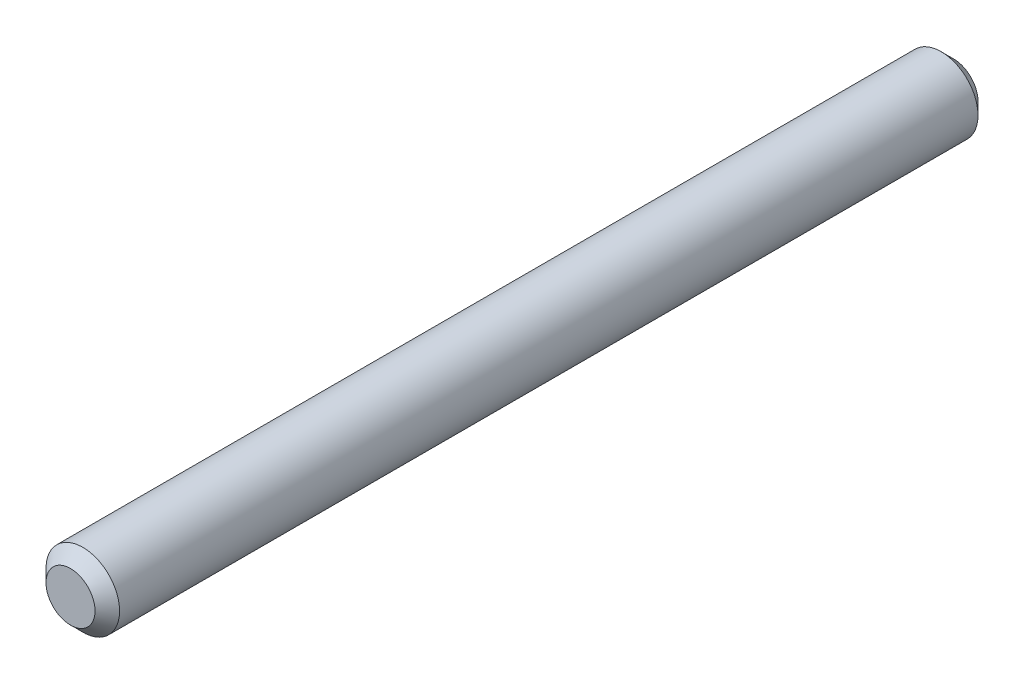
ISO-10303-21;
HEADER;
FILE_DESCRIPTION(('STEP AP214'),'2;1');
FILE_NAME('part.step','',(''),(''),'','','');
FILE_SCHEMA(('AUTOMOTIVE_DESIGN { 1 0 10303 214 1 1 1 1 }'));
ENDSEC;
DATA;
#1=APPLICATION_CONTEXT('core data for automotive mechanical design processes');
#2=APPLICATION_PROTOCOL_DEFINITION('international standard','automotive_design',2000,#1);
#3=PRODUCT_CONTEXT('',#1,'mechanical');
#4=PRODUCT('Part','Part','',(#3));
#5=PRODUCT_RELATED_PRODUCT_CATEGORY('part','',(#4));
#6=PRODUCT_DEFINITION_FORMATION('','',#4);
#7=PRODUCT_DEFINITION_CONTEXT('part definition',#1,'design');
#8=PRODUCT_DEFINITION('design','',#6,#7);
#9=PRODUCT_DEFINITION_SHAPE('','',#8);
#10=(LENGTH_UNIT() NAMED_UNIT(*) SI_UNIT(.MILLI.,.METRE.));
#11=(NAMED_UNIT(*) PLANE_ANGLE_UNIT() SI_UNIT($,.RADIAN.));
#12=(NAMED_UNIT(*) SI_UNIT($,.STERADIAN.) SOLID_ANGLE_UNIT());
#13=UNCERTAINTY_MEASURE_WITH_UNIT(LENGTH_MEASURE(1.E-05),#10,'distance_accuracy_value','');
#14=(GEOMETRIC_REPRESENTATION_CONTEXT(3) GLOBAL_UNCERTAINTY_ASSIGNED_CONTEXT((#13)) GLOBAL_UNIT_ASSIGNED_CONTEXT((#10,
#11,#12)) REPRESENTATION_CONTEXT('',''));
#15=CARTESIAN_POINT('',(0.,0.,0.));
#16=DIRECTION('',(0.,0.,1.));
#17=DIRECTION('',(1.,0.,0.));
#18=AXIS2_PLACEMENT_3D('',#15,#16,#17);
#19=CARTESIAN_POINT('',(0.,0.,36.));
#20=DIRECTION('',(0.,0.,-1.));
#21=DIRECTION('',(-1.,0.,0.));
#22=AXIS2_PLACEMENT_3D('',#19,#20,#21);
#23=CYLINDRICAL_SURFACE('',#22,1.5);
#24=CARTESIAN_POINT('',(0.,0.,35.5));
#25=DIRECTION('',(0.,0.,1.));
#26=DIRECTION('',(1.,0.,0.));
#27=AXIS2_PLACEMENT_3D('',#24,#25,#26);
#28=CIRCLE('',#27,1.5);
#29=CARTESIAN_POINT('',(1.5,0.,35.5));
#30=VERTEX_POINT('',#29);
#31=EDGE_CURVE('E32',#30,#30,#28,.F.);
#32=ORIENTED_EDGE('',*,*,#31,.T.);
#33=EDGE_LOOP('',(#32));
#34=FACE_BOUND('',#33,.T.);
#35=CARTESIAN_POINT('',(0.,0.,0.5));
#36=DIRECTION('',(0.,0.,1.));
#37=DIRECTION('',(1.,0.,0.));
#38=AXIS2_PLACEMENT_3D('',#35,#36,#37);
#39=CIRCLE('',#38,1.5);
#40=CARTESIAN_POINT('',(1.5,0.,0.5));
#41=VERTEX_POINT('',#40);
#42=EDGE_CURVE('E36',#41,#41,#39,.T.);
#43=ORIENTED_EDGE('',*,*,#42,.T.);
#44=EDGE_LOOP('',(#43));
#45=FACE_BOUND('',#44,.T.);
#46=ADVANCED_FACE('F26',(#34,#45),#23,.T.);
#47=CARTESIAN_POINT('',(0.,0.,36.));
#48=DIRECTION('',(0.,0.,1.));
#49=DIRECTION('',(1.,0.,0.));
#50=AXIS2_PLACEMENT_3D('',#47,#48,#49);
#51=PLANE('',#50);
#52=CARTESIAN_POINT('',(0.,0.,36.));
#53=DIRECTION('',(0.,0.,1.));
#54=DIRECTION('',(1.,0.,0.));
#55=AXIS2_PLACEMENT_3D('',#52,#53,#54);
#56=CIRCLE('',#55,0.99999999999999);
#57=CARTESIAN_POINT('',(0.99999999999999,0.,36.));
#58=VERTEX_POINT('',#57);
#59=EDGE_CURVE('E40',#58,#58,#56,.T.);
#60=ORIENTED_EDGE('',*,*,#59,.T.);
#61=EDGE_LOOP('',(#60));
#62=FACE_BOUND('',#61,.T.);
#63=ADVANCED_FACE('F46',(#62),#51,.T.);
#64=CARTESIAN_POINT('',(0.,0.,0.));
#65=DIRECTION('',(0.,0.,1.));
#66=DIRECTION('',(1.,0.,0.));
#67=AXIS2_PLACEMENT_3D('',#64,#65,#66);
#68=PLANE('',#67);
#69=CARTESIAN_POINT('',(0.,0.,0.));
#70=DIRECTION('',(0.,0.,1.));
#71=DIRECTION('',(1.,0.,0.));
#72=AXIS2_PLACEMENT_3D('',#69,#70,#71);
#73=CIRCLE('',#72,0.999999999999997);
#74=CARTESIAN_POINT('',(0.999999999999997,0.,0.));
#75=VERTEX_POINT('',#74);
#76=EDGE_CURVE('E10',#75,#75,#73,.F.);
#77=ORIENTED_EDGE('',*,*,#76,.T.);
#78=EDGE_LOOP('',(#77));
#79=FACE_BOUND('',#78,.T.);
#80=ADVANCED_FACE('F51',(#79),#68,.F.);
#81=CARTESIAN_POINT('',(0.,0.,36.));
#82=DIRECTION('',(0.,0.,-1.));
#83=DIRECTION('',(-1.,0.,0.));
#84=AXIS2_PLACEMENT_3D('',#81,#82,#83);
#85=CONICAL_SURFACE('',#84,0.99999999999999,0.785398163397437);
#86=ORIENTED_EDGE('',*,*,#31,.F.);
#87=EDGE_LOOP('',(#86));
#88=FACE_BOUND('',#87,.T.);
#89=ORIENTED_EDGE('',*,*,#59,.F.);
#90=EDGE_LOOP('',(#89));
#91=FACE_BOUND('',#90,.T.);
#92=ADVANCED_FACE('F48',(#88,#91),#85,.T.);
#93=CARTESIAN_POINT('',(0.,0.,0.5));
#94=DIRECTION('',(0.,0.,1.));
#95=DIRECTION('',(1.,0.,0.));
#96=AXIS2_PLACEMENT_3D('',#93,#94,#95);
#97=CONICAL_SURFACE('',#96,1.5,0.785398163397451);
#98=ORIENTED_EDGE('',*,*,#76,.F.);
#99=EDGE_LOOP('',(#98));
#100=FACE_BOUND('',#99,.T.);
#101=ORIENTED_EDGE('',*,*,#42,.F.);
#102=EDGE_LOOP('',(#101));
#103=FACE_BOUND('',#102,.T.);
#104=ADVANCED_FACE('F50',(#100,#103),#97,.T.);
#105=CLOSED_SHELL('',(#46,#63,#80,#92,#104));
#106=MANIFOLD_SOLID_BREP('B2',#105);
#107=ADVANCED_BREP_SHAPE_REPRESENTATION('',(#18,#106),#14);
#108=SHAPE_DEFINITION_REPRESENTATION(#9,#107);
ENDSEC;
END-ISO-10303-21;
